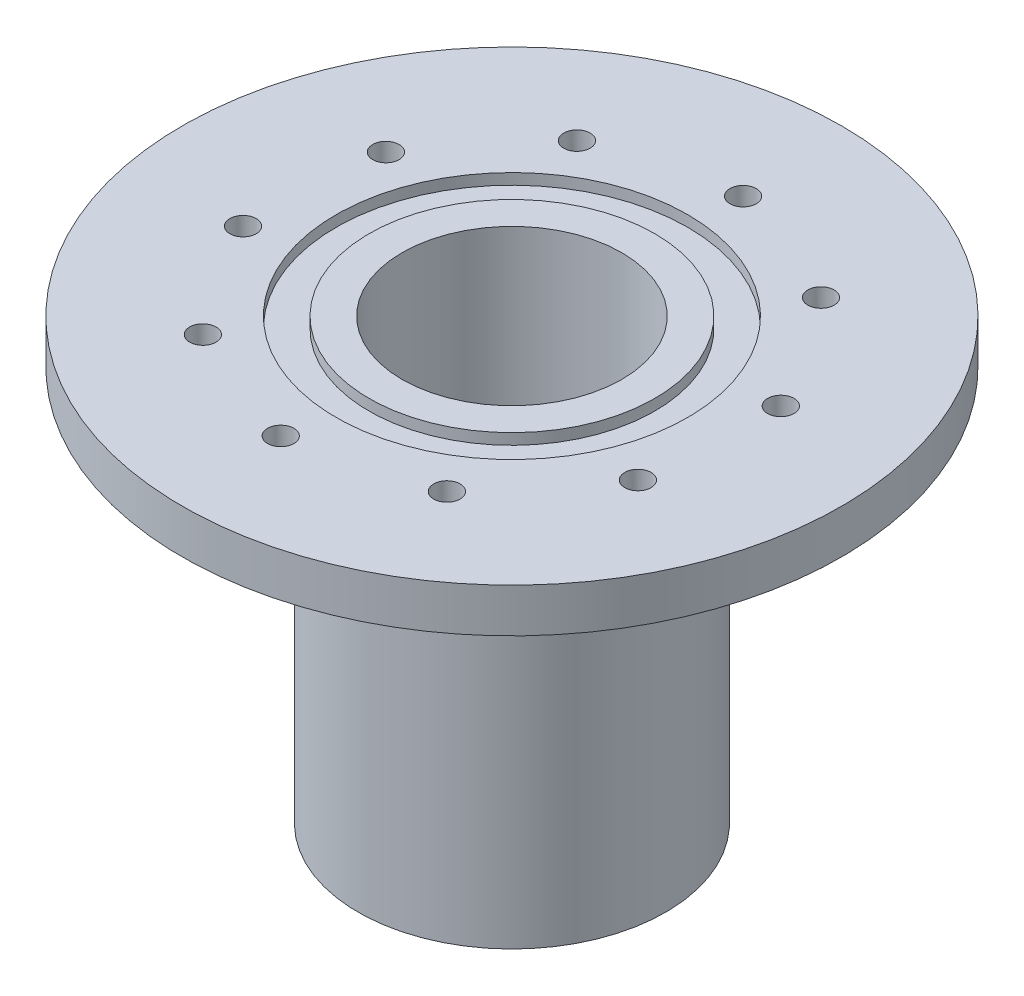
ISO-10303-21;
HEADER;
FILE_DESCRIPTION(('STEP AP214'),'2;1');
FILE_NAME('part.step','',(''),(''),'','','');
FILE_SCHEMA(('AUTOMOTIVE_DESIGN { 1 0 10303 214 1 1 1 1 }'));
ENDSEC;
DATA;
#1=APPLICATION_CONTEXT('core data for automotive mechanical design processes');
#2=APPLICATION_PROTOCOL_DEFINITION('international standard','automotive_design',2000,#1);
#3=PRODUCT_CONTEXT('',#1,'mechanical');
#4=PRODUCT('Part','Part','',(#3));
#5=PRODUCT_RELATED_PRODUCT_CATEGORY('part','',(#4));
#6=PRODUCT_DEFINITION_FORMATION('','',#4);
#7=PRODUCT_DEFINITION_CONTEXT('part definition',#1,'design');
#8=PRODUCT_DEFINITION('design','',#6,#7);
#9=PRODUCT_DEFINITION_SHAPE('','',#8);
#10=(LENGTH_UNIT() NAMED_UNIT(*) SI_UNIT(.MILLI.,.METRE.));
#11=(NAMED_UNIT(*) PLANE_ANGLE_UNIT() SI_UNIT($,.RADIAN.));
#12=(NAMED_UNIT(*) SI_UNIT($,.STERADIAN.) SOLID_ANGLE_UNIT());
#13=UNCERTAINTY_MEASURE_WITH_UNIT(LENGTH_MEASURE(1.E-05),#10,'distance_accuracy_value','');
#14=(GEOMETRIC_REPRESENTATION_CONTEXT(3) GLOBAL_UNCERTAINTY_ASSIGNED_CONTEXT((#13)) GLOBAL_UNIT_ASSIGNED_CONTEXT((#10,
#11,#12)) REPRESENTATION_CONTEXT('',''));
#15=CARTESIAN_POINT('',(0.,0.,0.));
#16=DIRECTION('',(0.,0.,1.));
#17=DIRECTION('',(1.,0.,0.));
#18=AXIS2_PLACEMENT_3D('',#15,#16,#17);
#19=CARTESIAN_POINT('',(-70.,0.,0.));
#20=DIRECTION('',(0.,1.,0.));
#21=DIRECTION('',(0.,0.,1.));
#22=AXIS2_PLACEMENT_3D('',#19,#20,#21);
#23=PLANE('',#22);
#24=CARTESIAN_POINT('',(0.,0.,0.));
#25=DIRECTION('',(0.,-1.,0.));
#26=DIRECTION('',(0.,0.,-1.));
#27=AXIS2_PLACEMENT_3D('',#24,#25,#26);
#28=CIRCLE('',#27,50.);
#29=CARTESIAN_POINT('',(0.,0.,-50.));
#30=VERTEX_POINT('',#29);
#31=EDGE_CURVE('E11',#30,#30,#28,.T.);
#32=ORIENTED_EDGE('',*,*,#31,.F.);
#33=EDGE_LOOP('',(#32));
#34=FACE_BOUND('',#33,.T.);
#35=CARTESIAN_POINT('',(0.,0.,0.));
#36=DIRECTION('',(0.,-1.,0.));
#37=DIRECTION('',(0.,0.,-1.));
#38=AXIS2_PLACEMENT_3D('',#35,#36,#37);
#39=CIRCLE('',#38,70.);
#40=CARTESIAN_POINT('',(0.,0.,-70.));
#41=VERTEX_POINT('',#40);
#42=EDGE_CURVE('E434',#41,#41,#39,.T.);
#43=ORIENTED_EDGE('',*,*,#42,.T.);
#44=EDGE_LOOP('',(#43));
#45=FACE_BOUND('',#44,.T.);
#46=ADVANCED_FACE('F44',(#34,#45),#23,.F.);
#47=CARTESIAN_POINT('',(0.,0.,0.));
#48=DIRECTION('',(0.,-1.,0.));
#49=DIRECTION('',(0.,0.,-1.));
#50=AXIS2_PLACEMENT_3D('',#47,#48,#49);
#51=CYLINDRICAL_SURFACE('',#50,50.);
#52=CARTESIAN_POINT('',(0.,200.,0.));
#53=DIRECTION('',(0.,-1.,0.));
#54=DIRECTION('',(0.,0.,-1.));
#55=AXIS2_PLACEMENT_3D('',#52,#53,#54);
#56=CIRCLE('',#55,50.);
#57=CARTESIAN_POINT('',(0.,200.,-50.));
#58=VERTEX_POINT('',#57);
#59=EDGE_CURVE('E51',#58,#58,#56,.T.);
#60=ORIENTED_EDGE('',*,*,#59,.F.);
#61=EDGE_LOOP('',(#60));
#62=FACE_BOUND('',#61,.T.);
#63=ORIENTED_EDGE('',*,*,#31,.T.);
#64=EDGE_LOOP('',(#63));
#65=FACE_BOUND('',#64,.T.);
#66=ADVANCED_FACE('F183',(#62,#65),#51,.F.);
#67=CARTESIAN_POINT('',(-50.,200.,0.));
#68=DIRECTION('',(0.,-1.,0.));
#69=DIRECTION('',(0.,0.,-1.));
#70=AXIS2_PLACEMENT_3D('',#67,#68,#69);
#71=PLANE('',#70);
#72=CARTESIAN_POINT('',(0.,200.,0.));
#73=DIRECTION('',(0.,-1.,0.));
#74=DIRECTION('',(0.,0.,-1.));
#75=AXIS2_PLACEMENT_3D('',#72,#73,#74);
#76=CIRCLE('',#75,65.);
#77=CARTESIAN_POINT('',(0.,200.,-65.));
#78=VERTEX_POINT('',#77);
#79=EDGE_CURVE('E56',#78,#78,#76,.T.);
#80=ORIENTED_EDGE('',*,*,#79,.F.);
#81=EDGE_LOOP('',(#80));
#82=FACE_BOUND('',#81,.T.);
#83=ORIENTED_EDGE('',*,*,#59,.T.);
#84=EDGE_LOOP('',(#83));
#85=FACE_BOUND('',#84,.T.);
#86=ADVANCED_FACE('F180',(#82,#85),#71,.F.);
#87=CARTESIAN_POINT('',(0.,0.,0.));
#88=DIRECTION('',(0.,-1.,0.));
#89=DIRECTION('',(0.,0.,-1.));
#90=AXIS2_PLACEMENT_3D('',#87,#88,#89);
#91=CYLINDRICAL_SURFACE('',#90,65.);
#92=CARTESIAN_POINT('',(0.,195.,0.));
#93=DIRECTION('',(0.,-1.,0.));
#94=DIRECTION('',(0.,0.,-1.));
#95=AXIS2_PLACEMENT_3D('',#92,#93,#94);
#96=CIRCLE('',#95,65.);
#97=CARTESIAN_POINT('',(0.,195.,-65.));
#98=VERTEX_POINT('',#97);
#99=EDGE_CURVE('E168',#98,#98,#96,.T.);
#100=ORIENTED_EDGE('',*,*,#99,.F.);
#101=EDGE_LOOP('',(#100));
#102=FACE_BOUND('',#101,.T.);
#103=ORIENTED_EDGE('',*,*,#79,.T.);
#104=EDGE_LOOP('',(#103));
#105=FACE_BOUND('',#104,.T.);
#106=ADVANCED_FACE('F178',(#102,#105),#91,.T.);
#107=CARTESIAN_POINT('',(-80.,195.,0.));
#108=DIRECTION('',(0.,-1.,0.));
#109=DIRECTION('',(0.,0.,-1.));
#110=AXIS2_PLACEMENT_3D('',#107,#108,#109);
#111=PLANE('',#110);
#112=CARTESIAN_POINT('',(0.,195.,0.));
#113=DIRECTION('',(0.,-1.,0.));
#114=DIRECTION('',(0.,0.,-1.));
#115=AXIS2_PLACEMENT_3D('',#112,#113,#114);
#116=CIRCLE('',#115,80.);
#117=CARTESIAN_POINT('',(0.,195.,-80.));
#118=VERTEX_POINT('',#117);
#119=EDGE_CURVE('E165',#118,#118,#116,.T.);
#120=ORIENTED_EDGE('',*,*,#119,.F.);
#121=EDGE_LOOP('',(#120));
#122=FACE_BOUND('',#121,.T.);
#123=ORIENTED_EDGE('',*,*,#99,.T.);
#124=EDGE_LOOP('',(#123));
#125=FACE_BOUND('',#124,.T.);
#126=ADVANCED_FACE('F194',(#122,#125),#111,.F.);
#127=CARTESIAN_POINT('',(0.,0.,0.));
#128=DIRECTION('',(0.,-1.,0.));
#129=DIRECTION('',(0.,0.,-1.));
#130=AXIS2_PLACEMENT_3D('',#127,#128,#129);
#131=CYLINDRICAL_SURFACE('',#130,80.);
#132=CARTESIAN_POINT('',(0.,200.,0.));
#133=DIRECTION('',(0.,-1.,0.));
#134=DIRECTION('',(0.,0.,-1.));
#135=AXIS2_PLACEMENT_3D('',#132,#133,#134);
#136=CIRCLE('',#135,80.);
#137=CARTESIAN_POINT('',(0.,200.,-80.));
#138=VERTEX_POINT('',#137);
#139=EDGE_CURVE('E163',#138,#138,#136,.T.);
#140=ORIENTED_EDGE('',*,*,#139,.F.);
#141=EDGE_LOOP('',(#140));
#142=FACE_BOUND('',#141,.T.);
#143=ORIENTED_EDGE('',*,*,#119,.T.);
#144=EDGE_LOOP('',(#143));
#145=FACE_BOUND('',#144,.T.);
#146=ADVANCED_FACE('F130',(#142,#145),#131,.F.);
#147=CARTESIAN_POINT('',(-80.,200.,0.));
#148=DIRECTION('',(0.,-1.,0.));
#149=DIRECTION('',(0.,0.,-1.));
#150=AXIS2_PLACEMENT_3D('',#147,#148,#149);
#151=PLANE('',#150);
#152=CARTESIAN_POINT('',(5.36512921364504,200.,-99.8559732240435));
#153=DIRECTION('',(0.,-1.,0.));
#154=DIRECTION('',(0.,0.,-1.));
#155=AXIS2_PLACEMENT_3D('',#152,#153,#154);
#156=CIRCLE('',#155,5.99999999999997);
#157=CARTESIAN_POINT('',(5.36512921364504,200.,-105.855973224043));
#158=VERTEX_POINT('',#157);
#159=EDGE_CURVE('E47',#158,#158,#156,.T.);
#160=ORIENTED_EDGE('',*,*,#159,.T.);
#161=EDGE_LOOP('',(#160));
#162=FACE_BOUND('',#161,.T.);
#163=CARTESIAN_POINT('',(63.0343491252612,200.,-77.6316354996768));
#164=DIRECTION('',(0.,-1.,0.));
#165=DIRECTION('',(0.,0.,-1.));
#166=AXIS2_PLACEMENT_3D('',#163,#164,#165);
#167=CIRCLE('',#166,5.99999999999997);
#168=CARTESIAN_POINT('',(63.0343491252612,200.,-83.6316354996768));
#169=VERTEX_POINT('',#168);
#170=EDGE_CURVE('E83',#169,#169,#167,.T.);
#171=ORIENTED_EDGE('',*,*,#170,.T.);
#172=EDGE_LOOP('',(#171));
#173=FACE_BOUND('',#172,.T.);
#174=CARTESIAN_POINT('',(96.6265901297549,200.,-25.7546516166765));
#175=DIRECTION('',(0.,-1.,0.));
#176=DIRECTION('',(0.,0.,-1.));
#177=AXIS2_PLACEMENT_3D('',#174,#175,#176);
#178=CIRCLE('',#177,5.99999999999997);
#179=CARTESIAN_POINT('',(96.6265901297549,200.,-31.7546516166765));
#180=VERTEX_POINT('',#179);
#181=EDGE_CURVE('E86',#180,#180,#178,.T.);
#182=ORIENTED_EDGE('',*,*,#181,.T.);
#183=EDGE_LOOP('',(#182));
#184=FACE_BOUND('',#183,.T.);
#185=CARTESIAN_POINT('',(93.3107579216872,200.,35.9597338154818));
#186=DIRECTION('',(0.,-1.,0.));
#187=DIRECTION('',(0.,0.,-1.));
#188=AXIS2_PLACEMENT_3D('',#185,#186,#187);
#189=CIRCLE('',#188,5.99999999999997);
#190=CARTESIAN_POINT('',(93.3107579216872,200.,29.9597338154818));
#191=VERTEX_POINT('',#190);
#192=EDGE_CURVE('E92',#191,#191,#189,.T.);
#193=ORIENTED_EDGE('',*,*,#192,.T.);
#194=EDGE_LOOP('',(#193));
#195=FACE_BOUND('',#194,.T.);
#196=CARTESIAN_POINT('',(54.3533877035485,200.,83.9387231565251));
#197=DIRECTION('',(0.,-1.,0.));
#198=DIRECTION('',(0.,0.,-1.));
#199=AXIS2_PLACEMENT_3D('',#196,#197,#198);
#200=CIRCLE('',#199,5.99999999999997);
#201=CARTESIAN_POINT('',(54.3533877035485,200.,77.9387231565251));
#202=VERTEX_POINT('',#201);
#203=EDGE_CURVE('E104',#202,#202,#200,.T.);
#204=ORIENTED_EDGE('',*,*,#203,.T.);
#205=EDGE_LOOP('',(#204));
#206=FACE_BOUND('',#205,.T.);
#207=CARTESIAN_POINT('',(-5.36512921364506,200.,99.8559732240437));
#208=DIRECTION('',(0.,-1.,0.));
#209=DIRECTION('',(0.,0.,-1.));
#210=AXIS2_PLACEMENT_3D('',#207,#208,#209);
#211=CIRCLE('',#210,5.99999999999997);
#212=CARTESIAN_POINT('',(-5.36512921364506,200.,93.8559732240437));
#213=VERTEX_POINT('',#212);
#214=EDGE_CURVE('E105',#213,#213,#211,.T.);
#215=ORIENTED_EDGE('',*,*,#214,.T.);
#216=EDGE_LOOP('',(#215));
#217=FACE_BOUND('',#216,.T.);
#218=CARTESIAN_POINT('',(-63.0343491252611,200.,77.631635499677));
#219=DIRECTION('',(0.,-1.,0.));
#220=DIRECTION('',(0.,0.,-1.));
#221=AXIS2_PLACEMENT_3D('',#218,#219,#220);
#222=CIRCLE('',#221,5.99999999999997);
#223=CARTESIAN_POINT('',(-63.0343491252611,200.,71.631635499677));
#224=VERTEX_POINT('',#223);
#225=EDGE_CURVE('E146',#224,#224,#222,.T.);
#226=ORIENTED_EDGE('',*,*,#225,.T.);
#227=EDGE_LOOP('',(#226));
#228=FACE_BOUND('',#227,.T.);
#229=CARTESIAN_POINT('',(-96.6265901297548,200.,25.7546516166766));
#230=DIRECTION('',(0.,-1.,0.));
#231=DIRECTION('',(0.,0.,-1.));
#232=AXIS2_PLACEMENT_3D('',#229,#230,#231);
#233=CIRCLE('',#232,5.99999999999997);
#234=CARTESIAN_POINT('',(-96.6265901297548,200.,19.7546516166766));
#235=VERTEX_POINT('',#234);
#236=EDGE_CURVE('E150',#235,#235,#233,.T.);
#237=ORIENTED_EDGE('',*,*,#236,.T.);
#238=EDGE_LOOP('',(#237));
#239=FACE_BOUND('',#238,.T.);
#240=CARTESIAN_POINT('',(-93.3107579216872,200.,-35.9597338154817));
#241=DIRECTION('',(0.,-1.,0.));
#242=DIRECTION('',(0.,0.,-1.));
#243=AXIS2_PLACEMENT_3D('',#240,#241,#242);
#244=CIRCLE('',#243,5.99999999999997);
#245=CARTESIAN_POINT('',(-93.3107579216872,200.,-41.9597338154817));
#246=VERTEX_POINT('',#245);
#247=EDGE_CURVE('E66',#246,#246,#244,.T.);
#248=ORIENTED_EDGE('',*,*,#247,.T.);
#249=EDGE_LOOP('',(#248));
#250=FACE_BOUND('',#249,.T.);
#251=CARTESIAN_POINT('',(-54.3533877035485,200.,-83.938723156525));
#252=DIRECTION('',(0.,-1.,0.));
#253=DIRECTION('',(0.,0.,-1.));
#254=AXIS2_PLACEMENT_3D('',#251,#252,#253);
#255=CIRCLE('',#254,5.99999999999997);
#256=CARTESIAN_POINT('',(-54.3533877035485,200.,-89.938723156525));
#257=VERTEX_POINT('',#256);
#258=EDGE_CURVE('E65',#257,#257,#255,.T.);
#259=ORIENTED_EDGE('',*,*,#258,.T.);
#260=EDGE_LOOP('',(#259));
#261=FACE_BOUND('',#260,.T.);
#262=CARTESIAN_POINT('',(0.,200.,0.));
#263=DIRECTION('',(0.,-1.,0.));
#264=DIRECTION('',(0.,0.,-1.));
#265=AXIS2_PLACEMENT_3D('',#262,#263,#264);
#266=CIRCLE('',#265,150.);
#267=CARTESIAN_POINT('',(0.,200.,-150.));
#268=VERTEX_POINT('',#267);
#269=EDGE_CURVE('E160',#268,#268,#266,.T.);
#270=ORIENTED_EDGE('',*,*,#269,.F.);
#271=EDGE_LOOP('',(#270));
#272=FACE_BOUND('',#271,.T.);
#273=ORIENTED_EDGE('',*,*,#139,.T.);
#274=EDGE_LOOP('',(#273));
#275=FACE_BOUND('',#274,.T.);
#276=ADVANCED_FACE('F126',(#162,#173,#184,#195,#206,#217,#228,#239,#250,#261,#272,#275),#151,.F.);
#277=CARTESIAN_POINT('',(0.,0.,0.));
#278=DIRECTION('',(0.,-1.,0.));
#279=DIRECTION('',(0.,0.,-1.));
#280=AXIS2_PLACEMENT_3D('',#277,#278,#279);
#281=CYLINDRICAL_SURFACE('',#280,150.);
#282=CARTESIAN_POINT('',(0.,180.,0.));
#283=DIRECTION('',(0.,-1.,0.));
#284=DIRECTION('',(0.,0.,-1.));
#285=AXIS2_PLACEMENT_3D('',#282,#283,#284);
#286=CIRCLE('',#285,150.);
#287=CARTESIAN_POINT('',(0.,180.,-150.));
#288=VERTEX_POINT('',#287);
#289=EDGE_CURVE('E170',#288,#288,#286,.T.);
#290=ORIENTED_EDGE('',*,*,#289,.F.);
#291=EDGE_LOOP('',(#290));
#292=FACE_BOUND('',#291,.T.);
#293=ORIENTED_EDGE('',*,*,#269,.T.);
#294=EDGE_LOOP('',(#293));
#295=FACE_BOUND('',#294,.T.);
#296=ADVANCED_FACE('F129',(#292,#295),#281,.T.);
#297=CARTESIAN_POINT('',(-150.,180.,0.));
#298=DIRECTION('',(0.,1.,0.));
#299=DIRECTION('',(0.,0.,1.));
#300=AXIS2_PLACEMENT_3D('',#297,#298,#299);
#301=PLANE('',#300);
#302=CARTESIAN_POINT('',(5.36512921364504,180.,-99.8559732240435));
#303=DIRECTION('',(0.,1.,0.));
#304=DIRECTION('',(0.,0.,1.));
#305=AXIS2_PLACEMENT_3D('',#302,#303,#304);
#306=CIRCLE('',#305,5.99999999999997);
#307=CARTESIAN_POINT('',(5.36512921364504,180.,-93.8559732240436));
#308=VERTEX_POINT('',#307);
#309=EDGE_CURVE('E77',#308,#308,#306,.T.);
#310=ORIENTED_EDGE('',*,*,#309,.T.);
#311=EDGE_LOOP('',(#310));
#312=FACE_BOUND('',#311,.T.);
#313=CARTESIAN_POINT('',(63.0343491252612,180.,-77.6316354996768));
#314=DIRECTION('',(0.,1.,0.));
#315=DIRECTION('',(0.,0.,1.));
#316=AXIS2_PLACEMENT_3D('',#313,#314,#315);
#317=CIRCLE('',#316,5.99999999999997);
#318=CARTESIAN_POINT('',(63.0343491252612,180.,-71.6316354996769));
#319=VERTEX_POINT('',#318);
#320=EDGE_CURVE('E82',#319,#319,#317,.T.);
#321=ORIENTED_EDGE('',*,*,#320,.T.);
#322=EDGE_LOOP('',(#321));
#323=FACE_BOUND('',#322,.T.);
#324=CARTESIAN_POINT('',(96.6265901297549,180.,-25.7546516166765));
#325=DIRECTION('',(0.,1.,0.));
#326=DIRECTION('',(0.,0.,1.));
#327=AXIS2_PLACEMENT_3D('',#324,#325,#326);
#328=CIRCLE('',#327,5.99999999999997);
#329=CARTESIAN_POINT('',(96.6265901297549,180.,-19.7546516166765));
#330=VERTEX_POINT('',#329);
#331=EDGE_CURVE('E87',#330,#330,#328,.T.);
#332=ORIENTED_EDGE('',*,*,#331,.T.);
#333=EDGE_LOOP('',(#332));
#334=FACE_BOUND('',#333,.T.);
#335=CARTESIAN_POINT('',(93.3107579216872,180.,35.9597338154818));
#336=DIRECTION('',(0.,1.,0.));
#337=DIRECTION('',(0.,0.,1.));
#338=AXIS2_PLACEMENT_3D('',#335,#336,#337);
#339=CIRCLE('',#338,5.99999999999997);
#340=CARTESIAN_POINT('',(93.3107579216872,180.,41.9597338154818));
#341=VERTEX_POINT('',#340);
#342=EDGE_CURVE('E93',#341,#341,#339,.T.);
#343=ORIENTED_EDGE('',*,*,#342,.T.);
#344=EDGE_LOOP('',(#343));
#345=FACE_BOUND('',#344,.T.);
#346=CARTESIAN_POINT('',(54.3533877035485,180.,83.9387231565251));
#347=DIRECTION('',(0.,1.,0.));
#348=DIRECTION('',(0.,0.,1.));
#349=AXIS2_PLACEMENT_3D('',#346,#347,#348);
#350=CIRCLE('',#349,5.99999999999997);
#351=CARTESIAN_POINT('',(54.3533877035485,180.,89.938723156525));
#352=VERTEX_POINT('',#351);
#353=EDGE_CURVE('E98',#352,#352,#350,.T.);
#354=ORIENTED_EDGE('',*,*,#353,.T.);
#355=EDGE_LOOP('',(#354));
#356=FACE_BOUND('',#355,.T.);
#357=CARTESIAN_POINT('',(-5.36512921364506,180.,99.8559732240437));
#358=DIRECTION('',(0.,1.,0.));
#359=DIRECTION('',(0.,0.,1.));
#360=AXIS2_PLACEMENT_3D('',#357,#358,#359);
#361=CIRCLE('',#360,5.99999999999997);
#362=CARTESIAN_POINT('',(-5.36512921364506,180.,105.855973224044));
#363=VERTEX_POINT('',#362);
#364=EDGE_CURVE('E409',#363,#363,#361,.T.);
#365=ORIENTED_EDGE('',*,*,#364,.T.);
#366=EDGE_LOOP('',(#365));
#367=FACE_BOUND('',#366,.T.);
#368=CARTESIAN_POINT('',(-63.0343491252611,180.,77.631635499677));
#369=DIRECTION('',(0.,1.,0.));
#370=DIRECTION('',(0.,0.,1.));
#371=AXIS2_PLACEMENT_3D('',#368,#369,#370);
#372=CIRCLE('',#371,5.99999999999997);
#373=CARTESIAN_POINT('',(-63.0343491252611,180.,83.631635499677));
#374=VERTEX_POINT('',#373);
#375=EDGE_CURVE('E413',#374,#374,#372,.T.);
#376=ORIENTED_EDGE('',*,*,#375,.T.);
#377=EDGE_LOOP('',(#376));
#378=FACE_BOUND('',#377,.T.);
#379=CARTESIAN_POINT('',(-96.6265901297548,180.,25.7546516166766));
#380=DIRECTION('',(0.,1.,0.));
#381=DIRECTION('',(0.,0.,1.));
#382=AXIS2_PLACEMENT_3D('',#379,#380,#381);
#383=CIRCLE('',#382,5.99999999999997);
#384=CARTESIAN_POINT('',(-96.6265901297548,180.,31.7546516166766));
#385=VERTEX_POINT('',#384);
#386=EDGE_CURVE('E417',#385,#385,#383,.T.);
#387=ORIENTED_EDGE('',*,*,#386,.T.);
#388=EDGE_LOOP('',(#387));
#389=FACE_BOUND('',#388,.T.);
#390=CARTESIAN_POINT('',(-93.3107579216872,180.,-35.9597338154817));
#391=DIRECTION('',(0.,1.,0.));
#392=DIRECTION('',(0.,0.,1.));
#393=AXIS2_PLACEMENT_3D('',#390,#391,#392);
#394=CIRCLE('',#393,5.99999999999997);
#395=CARTESIAN_POINT('',(-93.3107579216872,180.,-29.9597338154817));
#396=VERTEX_POINT('',#395);
#397=EDGE_CURVE('E67',#396,#396,#394,.T.);
#398=ORIENTED_EDGE('',*,*,#397,.T.);
#399=EDGE_LOOP('',(#398));
#400=FACE_BOUND('',#399,.T.);
#401=CARTESIAN_POINT('',(-54.3533877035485,180.,-83.938723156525));
#402=DIRECTION('',(0.,1.,0.));
#403=DIRECTION('',(0.,0.,1.));
#404=AXIS2_PLACEMENT_3D('',#401,#402,#403);
#405=CIRCLE('',#404,5.99999999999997);
#406=CARTESIAN_POINT('',(-54.3533877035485,180.,-77.938723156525));
#407=VERTEX_POINT('',#406);
#408=EDGE_CURVE('E60',#407,#407,#405,.T.);
#409=ORIENTED_EDGE('',*,*,#408,.T.);
#410=EDGE_LOOP('',(#409));
#411=FACE_BOUND('',#410,.T.);
#412=CARTESIAN_POINT('',(0.,180.,0.));
#413=DIRECTION('',(0.,-1.,0.));
#414=DIRECTION('',(0.,0.,-1.));
#415=AXIS2_PLACEMENT_3D('',#412,#413,#414);
#416=CIRCLE('',#415,75.0000000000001);
#417=CARTESIAN_POINT('',(0.,180.,-75.0000000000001));
#418=VERTEX_POINT('',#417);
#419=EDGE_CURVE('E426',#418,#418,#416,.T.);
#420=ORIENTED_EDGE('',*,*,#419,.F.);
#421=EDGE_LOOP('',(#420));
#422=FACE_BOUND('',#421,.T.);
#423=ORIENTED_EDGE('',*,*,#289,.T.);
#424=EDGE_LOOP('',(#423));
#425=FACE_BOUND('',#424,.T.);
#426=ADVANCED_FACE('F115',(#312,#323,#334,#345,#356,#367,#378,#389,#400,#411,#422,#425),#301,.F.);
#427=CARTESIAN_POINT('',(0.,175.,0.));
#428=DIRECTION('',(0.,-1.,0.));
#429=DIRECTION('',(0.,0.,-1.));
#430=AXIS2_PLACEMENT_3D('',#427,#428,#429);
#431=TOROIDAL_SURFACE('',#430,75.,5.);
#432=CARTESIAN_POINT('',(0.,175.,0.));
#433=DIRECTION('',(0.,-1.,0.));
#434=DIRECTION('',(0.,0.,-1.));
#435=AXIS2_PLACEMENT_3D('',#432,#433,#434);
#436=CIRCLE('',#435,70.);
#437=CARTESIAN_POINT('',(0.,175.,-70.));
#438=VERTEX_POINT('',#437);
#439=EDGE_CURVE('E429',#438,#438,#436,.T.);
#440=ORIENTED_EDGE('',*,*,#439,.F.);
#441=EDGE_LOOP('',(#440));
#442=FACE_BOUND('',#441,.T.);
#443=ORIENTED_EDGE('',*,*,#419,.T.);
#444=EDGE_LOOP('',(#443));
#445=FACE_BOUND('',#444,.T.);
#446=ADVANCED_FACE('F206',(#442,#445),#431,.F.);
#447=CARTESIAN_POINT('',(0.,0.,0.));
#448=DIRECTION('',(0.,-1.,0.));
#449=DIRECTION('',(0.,0.,-1.));
#450=AXIS2_PLACEMENT_3D('',#447,#448,#449);
#451=CYLINDRICAL_SURFACE('',#450,70.);
#452=ORIENTED_EDGE('',*,*,#42,.F.);
#453=EDGE_LOOP('',(#452));
#454=FACE_BOUND('',#453,.T.);
#455=ORIENTED_EDGE('',*,*,#439,.T.);
#456=EDGE_LOOP('',(#455));
#457=FACE_BOUND('',#456,.T.);
#458=ADVANCED_FACE('F210',(#454,#457),#451,.T.);
#459=CARTESIAN_POINT('',(-54.3533877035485,240.,-83.938723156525));
#460=DIRECTION('',(0.,1.,0.));
#461=DIRECTION('',(0.,0.,1.));
#462=AXIS2_PLACEMENT_3D('',#459,#460,#461);
#463=CYLINDRICAL_SURFACE('',#462,5.99999999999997);
#464=ORIENTED_EDGE('',*,*,#408,.F.);
#465=EDGE_LOOP('',(#464));
#466=FACE_BOUND('',#465,.T.);
#467=ORIENTED_EDGE('',*,*,#258,.F.);
#468=EDGE_LOOP('',(#467));
#469=FACE_BOUND('',#468,.T.);
#470=ADVANCED_FACE('F214',(#466,#469),#463,.F.);
#471=CARTESIAN_POINT('',(-93.3107579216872,240.,-35.9597338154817));
#472=DIRECTION('',(0.,1.,0.));
#473=DIRECTION('',(0.,0.,1.));
#474=AXIS2_PLACEMENT_3D('',#471,#472,#473);
#475=CYLINDRICAL_SURFACE('',#474,5.99999999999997);
#476=ORIENTED_EDGE('',*,*,#397,.F.);
#477=EDGE_LOOP('',(#476));
#478=FACE_BOUND('',#477,.T.);
#479=ORIENTED_EDGE('',*,*,#247,.F.);
#480=EDGE_LOOP('',(#479));
#481=FACE_BOUND('',#480,.T.);
#482=ADVANCED_FACE('F218',(#478,#481),#475,.F.);
#483=CARTESIAN_POINT('',(-96.6265901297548,240.,25.7546516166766));
#484=DIRECTION('',(0.,1.,0.));
#485=DIRECTION('',(0.,0.,1.));
#486=AXIS2_PLACEMENT_3D('',#483,#484,#485);
#487=CYLINDRICAL_SURFACE('',#486,5.99999999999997);
#488=ORIENTED_EDGE('',*,*,#386,.F.);
#489=EDGE_LOOP('',(#488));
#490=FACE_BOUND('',#489,.T.);
#491=ORIENTED_EDGE('',*,*,#236,.F.);
#492=EDGE_LOOP('',(#491));
#493=FACE_BOUND('',#492,.T.);
#494=ADVANCED_FACE('F222',(#490,#493),#487,.F.);
#495=CARTESIAN_POINT('',(-63.0343491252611,240.,77.631635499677));
#496=DIRECTION('',(0.,1.,0.));
#497=DIRECTION('',(0.,0.,1.));
#498=AXIS2_PLACEMENT_3D('',#495,#496,#497);
#499=CYLINDRICAL_SURFACE('',#498,5.99999999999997);
#500=ORIENTED_EDGE('',*,*,#375,.F.);
#501=EDGE_LOOP('',(#500));
#502=FACE_BOUND('',#501,.T.);
#503=ORIENTED_EDGE('',*,*,#225,.F.);
#504=EDGE_LOOP('',(#503));
#505=FACE_BOUND('',#504,.T.);
#506=ADVANCED_FACE('F226',(#502,#505),#499,.F.);
#507=CARTESIAN_POINT('',(-5.36512921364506,240.,99.8559732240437));
#508=DIRECTION('',(0.,1.,0.));
#509=DIRECTION('',(0.,0.,1.));
#510=AXIS2_PLACEMENT_3D('',#507,#508,#509);
#511=CYLINDRICAL_SURFACE('',#510,5.99999999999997);
#512=ORIENTED_EDGE('',*,*,#214,.F.);
#513=EDGE_LOOP('',(#512));
#514=FACE_BOUND('',#513,.T.);
#515=ORIENTED_EDGE('',*,*,#364,.F.);
#516=EDGE_LOOP('',(#515));
#517=FACE_BOUND('',#516,.T.);
#518=ADVANCED_FACE('F230',(#514,#517),#511,.F.);
#519=CARTESIAN_POINT('',(54.3533877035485,240.,83.9387231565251));
#520=DIRECTION('',(0.,1.,0.));
#521=DIRECTION('',(0.,0.,1.));
#522=AXIS2_PLACEMENT_3D('',#519,#520,#521);
#523=CYLINDRICAL_SURFACE('',#522,5.99999999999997);
#524=ORIENTED_EDGE('',*,*,#353,.F.);
#525=EDGE_LOOP('',(#524));
#526=FACE_BOUND('',#525,.T.);
#527=ORIENTED_EDGE('',*,*,#203,.F.);
#528=EDGE_LOOP('',(#527));
#529=FACE_BOUND('',#528,.T.);
#530=ADVANCED_FACE('F234',(#526,#529),#523,.F.);
#531=CARTESIAN_POINT('',(93.3107579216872,240.,35.9597338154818));
#532=DIRECTION('',(0.,1.,0.));
#533=DIRECTION('',(0.,0.,1.));
#534=AXIS2_PLACEMENT_3D('',#531,#532,#533);
#535=CYLINDRICAL_SURFACE('',#534,5.99999999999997);
#536=ORIENTED_EDGE('',*,*,#192,.F.);
#537=EDGE_LOOP('',(#536));
#538=FACE_BOUND('',#537,.T.);
#539=ORIENTED_EDGE('',*,*,#342,.F.);
#540=EDGE_LOOP('',(#539));
#541=FACE_BOUND('',#540,.T.);
#542=ADVANCED_FACE('F238',(#538,#541),#535,.F.);
#543=CARTESIAN_POINT('',(96.6265901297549,240.,-25.7546516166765));
#544=DIRECTION('',(0.,1.,0.));
#545=DIRECTION('',(0.,0.,1.));
#546=AXIS2_PLACEMENT_3D('',#543,#544,#545);
#547=CYLINDRICAL_SURFACE('',#546,5.99999999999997);
#548=ORIENTED_EDGE('',*,*,#181,.F.);
#549=EDGE_LOOP('',(#548));
#550=FACE_BOUND('',#549,.T.);
#551=ORIENTED_EDGE('',*,*,#331,.F.);
#552=EDGE_LOOP('',(#551));
#553=FACE_BOUND('',#552,.T.);
#554=ADVANCED_FACE('F122',(#550,#553),#547,.F.);
#555=CARTESIAN_POINT('',(63.0343491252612,240.,-77.6316354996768));
#556=DIRECTION('',(0.,1.,0.));
#557=DIRECTION('',(0.,0.,1.));
#558=AXIS2_PLACEMENT_3D('',#555,#556,#557);
#559=CYLINDRICAL_SURFACE('',#558,5.99999999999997);
#560=ORIENTED_EDGE('',*,*,#320,.F.);
#561=EDGE_LOOP('',(#560));
#562=FACE_BOUND('',#561,.T.);
#563=ORIENTED_EDGE('',*,*,#170,.F.);
#564=EDGE_LOOP('',(#563));
#565=FACE_BOUND('',#564,.T.);
#566=ADVANCED_FACE('F118',(#562,#565),#559,.F.);
#567=CARTESIAN_POINT('',(5.36512921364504,240.,-99.8559732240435));
#568=DIRECTION('',(0.,1.,0.));
#569=DIRECTION('',(0.,0.,1.));
#570=AXIS2_PLACEMENT_3D('',#567,#568,#569);
#571=CYLINDRICAL_SURFACE('',#570,5.99999999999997);
#572=ORIENTED_EDGE('',*,*,#159,.F.);
#573=EDGE_LOOP('',(#572));
#574=FACE_BOUND('',#573,.T.);
#575=ORIENTED_EDGE('',*,*,#309,.F.);
#576=EDGE_LOOP('',(#575));
#577=FACE_BOUND('',#576,.T.);
#578=ADVANCED_FACE('F121',(#574,#577),#571,.F.);
#579=CLOSED_SHELL('',(#46,#66,#86,#106,#126,#146,#276,#296,#426,#446,#458,#470,#482,#494,#506,
#518,#530,#542,#554,#566,#578));
#580=MANIFOLD_SOLID_BREP('B2',#579);
#581=ADVANCED_BREP_SHAPE_REPRESENTATION('',(#18,#580),#14);
#582=SHAPE_DEFINITION_REPRESENTATION(#9,#581);
ENDSEC;
END-ISO-10303-21;
